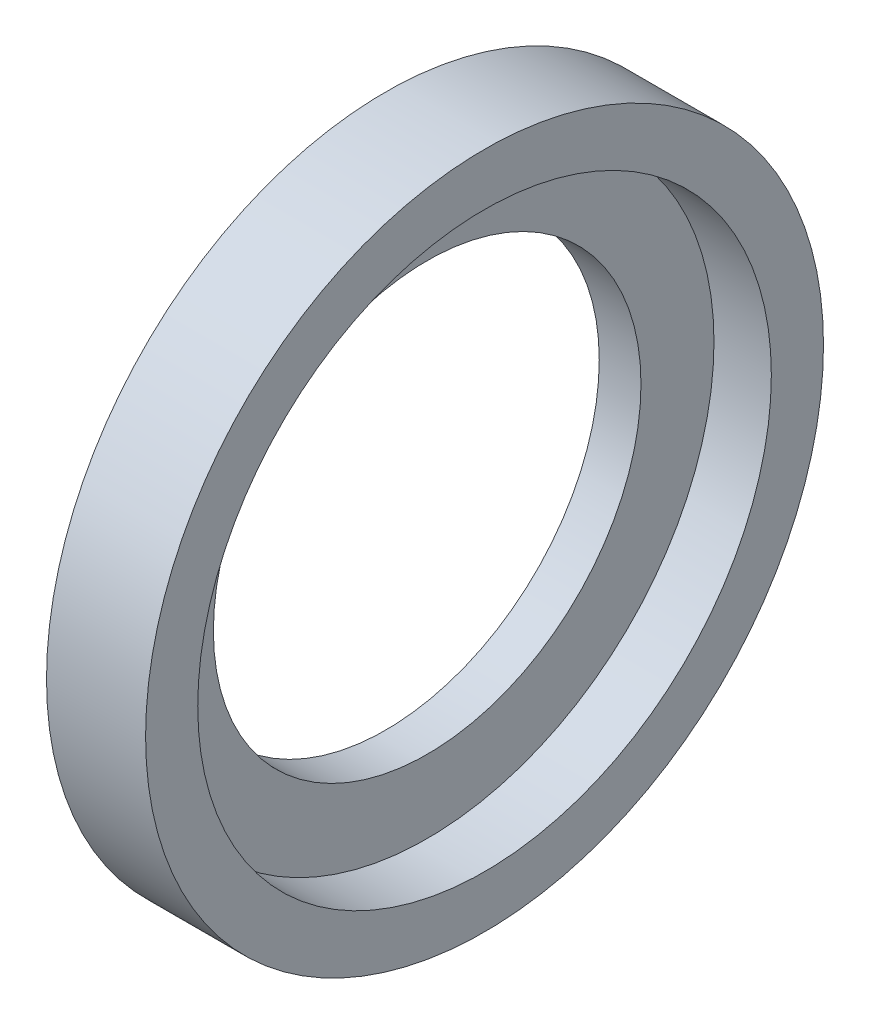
ISO-10303-21;
HEADER;
FILE_DESCRIPTION(('STEP AP214'),'2;1');
FILE_NAME('part.step','',(''),(''),'','','');
FILE_SCHEMA(('AUTOMOTIVE_DESIGN { 1 0 10303 214 1 1 1 1 }'));
ENDSEC;
DATA;
#1=APPLICATION_CONTEXT('core data for automotive mechanical design processes');
#2=APPLICATION_PROTOCOL_DEFINITION('international standard','automotive_design',2000,#1);
#3=PRODUCT_CONTEXT('',#1,'mechanical');
#4=PRODUCT('Part','Part','',(#3));
#5=PRODUCT_RELATED_PRODUCT_CATEGORY('part','',(#4));
#6=PRODUCT_DEFINITION_FORMATION('','',#4);
#7=PRODUCT_DEFINITION_CONTEXT('part definition',#1,'design');
#8=PRODUCT_DEFINITION('design','',#6,#7);
#9=PRODUCT_DEFINITION_SHAPE('','',#8);
#10=(LENGTH_UNIT() NAMED_UNIT(*) SI_UNIT(.MILLI.,.METRE.));
#11=(NAMED_UNIT(*) PLANE_ANGLE_UNIT() SI_UNIT($,.RADIAN.));
#12=(NAMED_UNIT(*) SI_UNIT($,.STERADIAN.) SOLID_ANGLE_UNIT());
#13=UNCERTAINTY_MEASURE_WITH_UNIT(LENGTH_MEASURE(1.E-05),#10,'distance_accuracy_value','');
#14=(GEOMETRIC_REPRESENTATION_CONTEXT(3) GLOBAL_UNCERTAINTY_ASSIGNED_CONTEXT((#13)) GLOBAL_UNIT_ASSIGNED_CONTEXT((#10,
#11,#12)) REPRESENTATION_CONTEXT('',''));
#15=CARTESIAN_POINT('',(0.,0.,0.));
#16=DIRECTION('',(0.,0.,1.));
#17=DIRECTION('',(1.,0.,0.));
#18=AXIS2_PLACEMENT_3D('',#15,#16,#17);
#19=CARTESIAN_POINT('',(1.9,0.,0.));
#20=DIRECTION('',(1.,0.,0.));
#21=DIRECTION('',(0.,0.,-1.));
#22=AXIS2_PLACEMENT_3D('',#19,#20,#21);
#23=CYLINDRICAL_SURFACE('',#22,5.5);
#24=CARTESIAN_POINT('',(0.8,0.,0.));
#25=DIRECTION('',(1.,0.,0.));
#26=DIRECTION('',(0.,0.,-1.));
#27=AXIS2_PLACEMENT_3D('',#24,#25,#26);
#28=CIRCLE('',#27,5.5);
#29=CARTESIAN_POINT('',(0.8,0.,-5.5));
#30=VERTEX_POINT('',#29);
#31=EDGE_CURVE('E34',#30,#30,#28,.T.);
#32=ORIENTED_EDGE('',*,*,#31,.F.);
#33=EDGE_LOOP('',(#32));
#34=FACE_BOUND('',#33,.T.);
#35=CARTESIAN_POINT('',(1.9,0.,0.));
#36=DIRECTION('',(1.,0.,0.));
#37=DIRECTION('',(0.,0.,-1.));
#38=AXIS2_PLACEMENT_3D('',#35,#36,#37);
#39=CIRCLE('',#38,5.5);
#40=CARTESIAN_POINT('',(1.9,0.,-5.5));
#41=VERTEX_POINT('',#40);
#42=EDGE_CURVE('E18',#41,#41,#39,.F.);
#43=ORIENTED_EDGE('',*,*,#42,.F.);
#44=EDGE_LOOP('',(#43));
#45=FACE_BOUND('',#44,.T.);
#46=ADVANCED_FACE('F14',(#34,#45),#23,.F.);
#47=CARTESIAN_POINT('',(1.9,0.,0.));
#48=DIRECTION('',(1.,0.,0.));
#49=DIRECTION('',(0.,0.,-1.));
#50=AXIS2_PLACEMENT_3D('',#47,#48,#49);
#51=PLANE('',#50);
#52=ORIENTED_EDGE('',*,*,#42,.T.);
#53=EDGE_LOOP('',(#52));
#54=FACE_BOUND('',#53,.T.);
#55=CARTESIAN_POINT('',(1.9,0.,0.));
#56=DIRECTION('',(1.,0.,0.));
#57=DIRECTION('',(0.,0.,-1.));
#58=AXIS2_PLACEMENT_3D('',#55,#56,#57);
#59=CIRCLE('',#58,6.5);
#60=CARTESIAN_POINT('',(1.9,0.,-6.5));
#61=VERTEX_POINT('',#60);
#62=EDGE_CURVE('E32',#61,#61,#59,.F.);
#63=ORIENTED_EDGE('',*,*,#62,.F.);
#64=EDGE_LOOP('',(#63));
#65=FACE_BOUND('',#64,.T.);
#66=ADVANCED_FACE('F41',(#54,#65),#51,.T.);
#67=CARTESIAN_POINT('',(0.8,0.,0.));
#68=DIRECTION('',(1.,0.,0.));
#69=DIRECTION('',(0.,0.,-1.));
#70=AXIS2_PLACEMENT_3D('',#67,#68,#69);
#71=PLANE('',#70);
#72=CARTESIAN_POINT('',(0.8,0.,0.));
#73=DIRECTION('',(1.,0.,0.));
#74=DIRECTION('',(0.,0.,-1.));
#75=AXIS2_PLACEMENT_3D('',#72,#73,#74);
#76=CIRCLE('',#75,4.1);
#77=CARTESIAN_POINT('',(0.8,0.,-4.1));
#78=VERTEX_POINT('',#77);
#79=EDGE_CURVE('E27',#78,#78,#76,.F.);
#80=ORIENTED_EDGE('',*,*,#79,.T.);
#81=EDGE_LOOP('',(#80));
#82=FACE_BOUND('',#81,.T.);
#83=ORIENTED_EDGE('',*,*,#31,.T.);
#84=EDGE_LOOP('',(#83));
#85=FACE_BOUND('',#84,.T.);
#86=ADVANCED_FACE('F51',(#82,#85),#71,.T.);
#87=CARTESIAN_POINT('',(0.,0.,0.));
#88=DIRECTION('',(1.,0.,0.));
#89=DIRECTION('',(0.,0.,-1.));
#90=AXIS2_PLACEMENT_3D('',#87,#88,#89);
#91=CYLINDRICAL_SURFACE('',#90,6.5);
#92=ORIENTED_EDGE('',*,*,#62,.T.);
#93=EDGE_LOOP('',(#92));
#94=FACE_BOUND('',#93,.T.);
#95=CARTESIAN_POINT('',(0.,0.,0.));
#96=DIRECTION('',(1.,0.,0.));
#97=DIRECTION('',(0.,0.,-1.));
#98=AXIS2_PLACEMENT_3D('',#95,#96,#97);
#99=CIRCLE('',#98,6.5);
#100=CARTESIAN_POINT('',(0.,0.,-6.5));
#101=VERTEX_POINT('',#100);
#102=EDGE_CURVE('E22',#101,#101,#99,.T.);
#103=ORIENTED_EDGE('',*,*,#102,.T.);
#104=EDGE_LOOP('',(#103));
#105=FACE_BOUND('',#104,.T.);
#106=ADVANCED_FACE('F59',(#94,#105),#91,.T.);
#107=CARTESIAN_POINT('',(0.,0.,0.));
#108=DIRECTION('',(1.,0.,0.));
#109=DIRECTION('',(0.,0.,-1.));
#110=AXIS2_PLACEMENT_3D('',#107,#108,#109);
#111=CYLINDRICAL_SURFACE('',#110,4.1);
#112=CARTESIAN_POINT('',(0.,0.,0.));
#113=DIRECTION('',(1.,0.,0.));
#114=DIRECTION('',(0.,0.,-1.));
#115=AXIS2_PLACEMENT_3D('',#112,#113,#114);
#116=CIRCLE('',#115,4.1);
#117=CARTESIAN_POINT('',(0.,0.,-4.1));
#118=VERTEX_POINT('',#117);
#119=EDGE_CURVE('E10',#118,#118,#116,.F.);
#120=ORIENTED_EDGE('',*,*,#119,.T.);
#121=EDGE_LOOP('',(#120));
#122=FACE_BOUND('',#121,.T.);
#123=ORIENTED_EDGE('',*,*,#79,.F.);
#124=EDGE_LOOP('',(#123));
#125=FACE_BOUND('',#124,.T.);
#126=ADVANCED_FACE('F54',(#122,#125),#111,.F.);
#127=CARTESIAN_POINT('',(0.,0.,0.));
#128=DIRECTION('',(1.,0.,0.));
#129=DIRECTION('',(0.,0.,-1.));
#130=AXIS2_PLACEMENT_3D('',#127,#128,#129);
#131=PLANE('',#130);
#132=ORIENTED_EDGE('',*,*,#119,.F.);
#133=EDGE_LOOP('',(#132));
#134=FACE_BOUND('',#133,.T.);
#135=ORIENTED_EDGE('',*,*,#102,.F.);
#136=EDGE_LOOP('',(#135));
#137=FACE_BOUND('',#136,.T.);
#138=ADVANCED_FACE('F16',(#134,#137),#131,.F.);
#139=CLOSED_SHELL('',(#46,#66,#86,#106,#126,#138));
#140=MANIFOLD_SOLID_BREP('B1',#139);
#141=ADVANCED_BREP_SHAPE_REPRESENTATION('',(#18,#140),#14);
#142=SHAPE_DEFINITION_REPRESENTATION(#9,#141);
ENDSEC;
END-ISO-10303-21;
